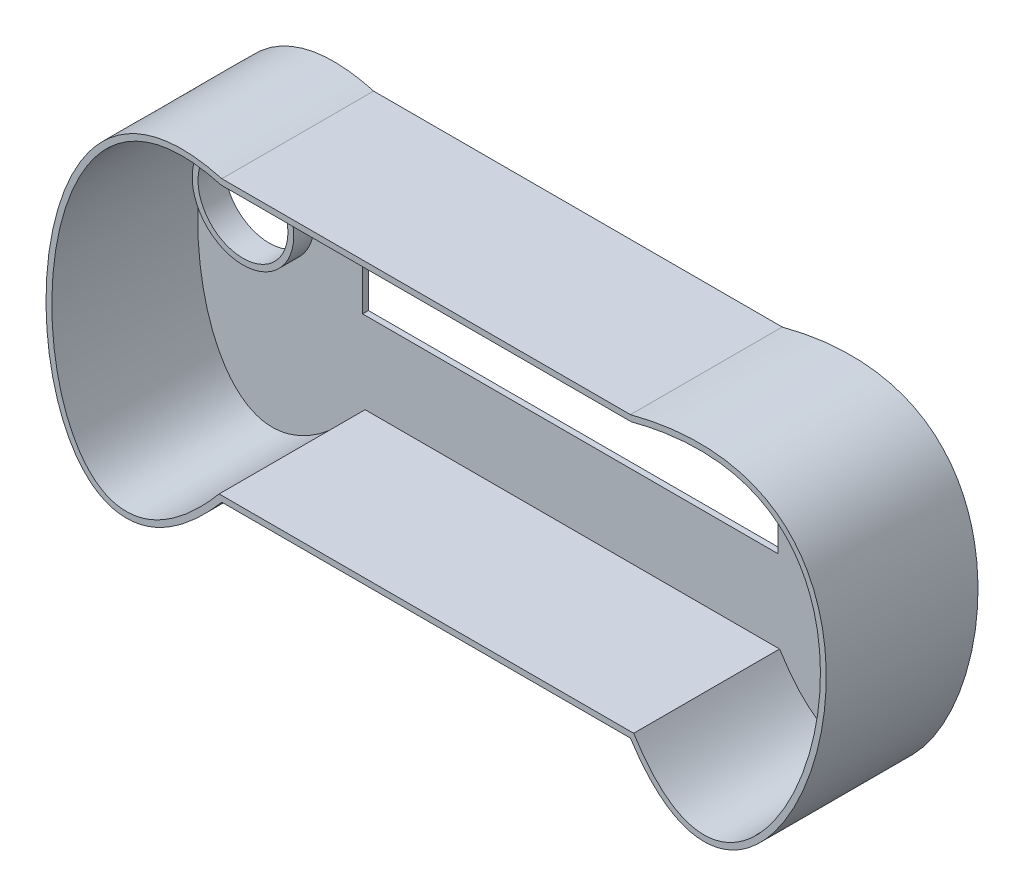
ISO-10303-21;
HEADER;
FILE_DESCRIPTION(('STEP AP214'),'2;1');
FILE_NAME('part.step','',(''),(''),'','','');
FILE_SCHEMA(('AUTOMOTIVE_DESIGN { 1 0 10303 214 1 1 1 1 }'));
ENDSEC;
DATA;
#1=APPLICATION_CONTEXT('core data for automotive mechanical design processes');
#2=APPLICATION_PROTOCOL_DEFINITION('international standard','automotive_design',2000,#1);
#3=PRODUCT_CONTEXT('',#1,'mechanical');
#4=PRODUCT('Part','Part','',(#3));
#5=PRODUCT_RELATED_PRODUCT_CATEGORY('part','',(#4));
#6=PRODUCT_DEFINITION_FORMATION('','',#4);
#7=PRODUCT_DEFINITION_CONTEXT('part definition',#1,'design');
#8=PRODUCT_DEFINITION('design','',#6,#7);
#9=PRODUCT_DEFINITION_SHAPE('','',#8);
#10=(LENGTH_UNIT() NAMED_UNIT(*) SI_UNIT(.MILLI.,.METRE.));
#11=(NAMED_UNIT(*) PLANE_ANGLE_UNIT() SI_UNIT($,.RADIAN.));
#12=(NAMED_UNIT(*) SI_UNIT($,.STERADIAN.) SOLID_ANGLE_UNIT());
#13=UNCERTAINTY_MEASURE_WITH_UNIT(LENGTH_MEASURE(1.E-05),#10,'distance_accuracy_value','');
#14=(GEOMETRIC_REPRESENTATION_CONTEXT(3) GLOBAL_UNCERTAINTY_ASSIGNED_CONTEXT((#13)) GLOBAL_UNIT_ASSIGNED_CONTEXT((#10,
#11,#12)) REPRESENTATION_CONTEXT('',''));
#15=CARTESIAN_POINT('',(0.,0.,0.));
#16=DIRECTION('',(0.,0.,1.));
#17=DIRECTION('',(1.,0.,0.));
#18=AXIS2_PLACEMENT_3D('',#15,#16,#17);
#19=CARTESIAN_POINT('',(4.92299908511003,22.9950717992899,0.));
#20=DIRECTION('',(0.,0.,1.));
#21=DIRECTION('',(1.,0.,0.));
#22=AXIS2_PLACEMENT_3D('',#19,#20,#21);
#23=PLANE('',#22);
#24=CARTESIAN_POINT('',(17.1147356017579,34.7971156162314,0.));
#25=DIRECTION('',(0.,0.,1.));
#26=DIRECTION('',(1.,0.,0.));
#27=AXIS2_PLACEMENT_3D('',#24,#25,#26);
#28=CIRCLE('',#27,8.7);
#29=CARTESIAN_POINT('',(25.8147356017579,34.7971156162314,0.));
#30=VERTEX_POINT('',#29);
#31=EDGE_CURVE('E328',#30,#30,#28,.T.);
#32=ORIENTED_EDGE('',*,*,#31,.F.);
#33=EDGE_LOOP('',(#32));
#34=FACE_BOUND('',#33,.T.);
#35=DIRECTION('',(0.,-1.,0.));
#36=VECTOR('',#35,1.);
#37=CARTESIAN_POINT('',(105.314735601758,49.7971156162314,0.));
#38=LINE('',#37,#36);
#39=CARTESIAN_POINT('',(105.314735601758,49.7971156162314,0.));
#40=VERTEX_POINT('',#39);
#41=CARTESIAN_POINT('',(105.314735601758,25.5971156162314,0.));
#42=VERTEX_POINT('',#41);
#43=EDGE_CURVE('E124',#40,#42,#38,.T.);
#44=ORIENTED_EDGE('',*,*,#43,.T.);
#45=DIRECTION('',(-1.,0.,0.));
#46=VECTOR('',#45,1.);
#47=CARTESIAN_POINT('',(105.314735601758,25.5971156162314,0.));
#48=LINE('',#47,#46);
#49=CARTESIAN_POINT('',(34.1147356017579,25.5971156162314,0.));
#50=VERTEX_POINT('',#49);
#51=EDGE_CURVE('E133',#42,#50,#48,.T.);
#52=ORIENTED_EDGE('',*,*,#51,.T.);
#53=DIRECTION('',(0.,1.,0.));
#54=VECTOR('',#53,1.);
#55=CARTESIAN_POINT('',(34.1147356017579,49.7971156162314,0.));
#56=LINE('',#55,#54);
#57=CARTESIAN_POINT('',(34.1147356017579,49.7971156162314,0.));
#58=VERTEX_POINT('',#57);
#59=EDGE_CURVE('E49',#50,#58,#56,.T.);
#60=ORIENTED_EDGE('',*,*,#59,.T.);
#61=DIRECTION('',(1.,0.,0.));
#62=VECTOR('',#61,1.);
#63=CARTESIAN_POINT('',(105.314735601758,49.7971156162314,0.));
#64=LINE('',#63,#62);
#65=EDGE_CURVE('E130',#58,#40,#64,.T.);
#66=ORIENTED_EDGE('',*,*,#65,.T.);
#67=EDGE_LOOP('',(#44,#52,#60,#66));
#68=FACE_BOUND('',#67,.T.);
#69=DIRECTION('',(-1.,0.,0.));
#70=VECTOR('',#69,1.);
#71=CARTESIAN_POINT('',(105.129049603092,57.5971156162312,0.));
#72=LINE('',#71,#70);
#73=CARTESIAN_POINT('',(105.129049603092,57.5971156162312,0.));
#74=VERTEX_POINT('',#73);
#75=CARTESIAN_POINT('',(34.8640749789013,57.5971156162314,0.));
#76=VERTEX_POINT('',#75);
#77=EDGE_CURVE('E246',#74,#76,#72,.T.);
#78=ORIENTED_EDGE('',*,*,#77,.T.);
#79=CARTESIAN_POINT('',(34.8640749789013,57.5971156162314,0.));
#80=CARTESIAN_POINT('',(34.5359122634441,57.688005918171,0.));
#81=CARTESIAN_POINT('',(33.8695946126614,57.8653706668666,0.));
#82=CARTESIAN_POINT('',(32.589473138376,58.1538757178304,0.));
#83=CARTESIAN_POINT('',(31.0301618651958,58.4184690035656,0.));
#84=CARTESIAN_POINT('',(29.2413395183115,58.581367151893,0.));
#85=CARTESIAN_POINT('',(26.9577687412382,58.6047509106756,0.));
#86=CARTESIAN_POINT('',(24.2921461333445,58.2868080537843,0.));
#87=CARTESIAN_POINT('',(20.405418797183,57.1061912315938,0.));
#88=CARTESIAN_POINT('',(16.2061984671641,54.4794709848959,0.));
#89=CARTESIAN_POINT('',(12.1481410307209,49.7855074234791,0.));
#90=CARTESIAN_POINT('',(9.07836724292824,43.8885033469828,0.));
#91=CARTESIAN_POINT('',(7.00172016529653,37.1736892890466,0.));
#92=CARTESIAN_POINT('',(5.90700760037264,30.0381631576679,0.));
#93=CARTESIAN_POINT('',(5.77162819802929,22.8816172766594,0.));
#94=CARTESIAN_POINT('',(6.56481193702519,16.1050150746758,0.));
#95=CARTESIAN_POINT('',(8.24516639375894,10.1138455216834,0.));
#96=CARTESIAN_POINT('',(10.7508480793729,5.31610445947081,0.));
#97=CARTESIAN_POINT('',(13.9656409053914,2.11506665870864,0.));
#98=CARTESIAN_POINT('',(17.1237983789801,0.968872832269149,0.));
#99=CARTESIAN_POINT('',(20.05030600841,1.06104875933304,0.));
#100=CARTESIAN_POINT('',(22.4836510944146,1.70871570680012,0.));
#101=CARTESIAN_POINT('',(25.1584900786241,3.00937023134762,0.));
#102=CARTESIAN_POINT('',(27.5789637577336,4.69289564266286,0.));
#103=CARTESIAN_POINT('',(29.6229555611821,6.42815456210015,0.));
#104=CARTESIAN_POINT('',(31.2070779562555,7.92870014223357,0.));
#105=CARTESIAN_POINT('',(32.5717833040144,9.35542883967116,0.));
#106=CARTESIAN_POINT('',(33.6821523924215,10.5940358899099,0.));
#107=CARTESIAN_POINT('',(34.2561176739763,11.265933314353,0.));
#108=CARTESIAN_POINT('',(34.5386426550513,11.5971156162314,0.));
#109=B_SPLINE_CURVE_WITH_KNOTS('',3,(#79,#80,#81,#82,#83,#84,#85,#86,#87,#88,#89,#90,#91,#92,
#93,#94,#95,#96,#97,#98,#99,#100,#101,#102,#103,#104,#105,#106,#107,#108),.UNSPECIFIED.,.F.,.F.,
(4,1,1,1,1,1,1,1,1,1,1,1,1,1,1,1,1,1,1,1,1,1,1,1,1,1,1,4),(-0.00100314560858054,
0.00683845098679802,0.0146800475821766,0.0303632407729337,0.0460464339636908,0.0617296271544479,
0.0930960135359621,0.124462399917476,0.187195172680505,0.249927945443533,0.312660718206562,
0.37539349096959,0.438126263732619,0.500859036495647,0.563591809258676,0.626324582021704,
0.689057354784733,0.751790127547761,0.814522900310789,0.845889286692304,0.877255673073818,
0.908622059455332,0.939988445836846,0.955671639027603,0.971354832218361,0.987038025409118,
0.994879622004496,1.00272121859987),.UNSPECIFIED.);
#110=CARTESIAN_POINT('',(34.5386426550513,11.5971156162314,0.));
#111=VERTEX_POINT('',#110);
#112=EDGE_CURVE('E168',#76,#111,#109,.T.);
#113=ORIENTED_EDGE('',*,*,#112,.T.);
#114=DIRECTION('',(1.,0.,0.));
#115=VECTOR('',#114,1.);
#116=CARTESIAN_POINT('',(105.549591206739,11.5971156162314,0.));
#117=LINE('',#116,#115);
#118=CARTESIAN_POINT('',(105.549591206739,11.5971156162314,0.));
#119=VERTEX_POINT('',#118);
#120=EDGE_CURVE('E255',#111,#119,#117,.T.);
#121=ORIENTED_EDGE('',*,*,#120,.T.);
#122=CARTESIAN_POINT('',(105.549591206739,11.5971156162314,0.));
#123=CARTESIAN_POINT('',(105.742871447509,11.2927236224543,0.));
#124=CARTESIAN_POINT('',(106.135036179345,10.6717388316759,0.));
#125=CARTESIAN_POINT('',(106.900552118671,9.54396310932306,0.));
#126=CARTESIAN_POINT('',(107.869141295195,8.250955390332,0.));
#127=CARTESIAN_POINT('',(109.031038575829,6.90950220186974,0.));
#128=CARTESIAN_POINT('',(110.57961756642,5.38102659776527,0.));
#129=CARTESIAN_POINT('',(112.501335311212,3.94433670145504,0.));
#130=CARTESIAN_POINT('',(114.759186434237,2.90605831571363,0.));
#131=CARTESIAN_POINT('',(116.964436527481,2.47518679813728,0.));
#132=CARTESIAN_POINT('',(119.859318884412,2.62568267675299,0.));
#133=CARTESIAN_POINT('',(123.445511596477,4.0922154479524,0.));
#134=CARTESIAN_POINT('',(127.553943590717,7.68809668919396,0.));
#135=CARTESIAN_POINT('',(131.212939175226,12.7695896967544,0.));
#136=CARTESIAN_POINT('',(134.22087719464,18.9366426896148,0.));
#137=CARTESIAN_POINT('',(136.398638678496,25.7851396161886,0.));
#138=CARTESIAN_POINT('',(137.581039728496,32.9101804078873,0.));
#139=CARTESIAN_POINT('',(137.612889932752,39.9052263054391,0.));
#140=CARTESIAN_POINT('',(136.353566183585,46.362923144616,0.));
#141=CARTESIAN_POINT('',(133.686555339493,51.8868591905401,0.));
#142=CARTESIAN_POINT('',(130.201078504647,55.4346853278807,0.));
#143=CARTESIAN_POINT('',(126.550601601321,57.5000970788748,0.));
#144=CARTESIAN_POINT('',(123.343547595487,58.6192688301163,0.));
#145=CARTESIAN_POINT('',(119.633375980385,59.2570007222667,0.));
#146=CARTESIAN_POINT('',(116.098863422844,59.3400592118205,0.));
#147=CARTESIAN_POINT('',(112.994018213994,59.1087416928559,0.));
#148=CARTESIAN_POINT('',(110.525791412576,58.7799193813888,0.));
#149=CARTESIAN_POINT('',(108.345988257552,58.3690253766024,0.));
#150=CARTESIAN_POINT('',(106.537919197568,57.9587108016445,0.));
#151=CARTESIAN_POINT('',(105.59422894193,57.719211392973,0.));
#152=CARTESIAN_POINT('',(105.129049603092,57.5971156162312,0.));
#153=B_SPLINE_CURVE_WITH_KNOTS('',3,(#122,#123,#124,#125,#126,#127,#128,#129,#130,#131,#132,
#133,#134,#135,#136,#137,#138,#139,#140,#141,#142,#143,#144,#145,#146,#147,#148,#149,#150,#151,
#152),.UNSPECIFIED.,.F.,.F.,(4,1,1,1,1,1,1,1,1,1,1,1,1,1,1,1,1,1,1,1,1,1,1,1,1,1,1,1,4),
(-0.000683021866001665,0.00716540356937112,0.0150138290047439,0.0307106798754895,
0.046407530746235,0.0621043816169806,0.0934980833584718,0.124891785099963,0.156285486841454,
0.187679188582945,0.250466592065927,0.313253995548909,0.376041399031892,0.438828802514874,
0.501616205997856,0.564403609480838,0.627191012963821,0.689978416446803,0.752765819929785,
0.815553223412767,0.846946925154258,0.878340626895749,0.90973432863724,0.941128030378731,
0.956824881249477,0.972521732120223,0.988218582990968,0.996067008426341,1.00391543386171),.UNSPECIFIED.);
#154=EDGE_CURVE('E250',#119,#74,#153,.T.);
#155=ORIENTED_EDGE('',*,*,#154,.T.);
#156=EDGE_LOOP('',(#78,#113,#121,#155));
#157=FACE_BOUND('',#156,.T.);
#158=CARTESIAN_POINT('',(122.314735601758,34.7971156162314,0.));
#159=DIRECTION('',(0.,0.,1.));
#160=DIRECTION('',(1.,0.,0.));
#161=AXIS2_PLACEMENT_3D('',#158,#159,#160);
#162=CIRCLE('',#161,8.70000000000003);
#163=CARTESIAN_POINT('',(131.014735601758,34.7971156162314,0.));
#164=VERTEX_POINT('',#163);
#165=EDGE_CURVE('E315',#164,#164,#162,.T.);
#166=ORIENTED_EDGE('',*,*,#165,.F.);
#167=EDGE_LOOP('',(#166));
#168=FACE_BOUND('',#167,.T.);
#169=ADVANCED_FACE('F32',(#34,#68,#157,#168),#23,.T.);
#170=CARTESIAN_POINT('',(4.92299908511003,22.9950717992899,25.));
#171=DIRECTION('',(0.,0.,-1.));
#172=DIRECTION('',(-1.,0.,0.));
#173=AXIS2_PLACEMENT_3D('',#170,#171,#172);
#174=PLANE('',#173);
#175=CARTESIAN_POINT('',(35.,58.5971156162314,25.));
#176=CARTESIAN_POINT('',(-8.52759174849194,70.6528299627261,25.));
#177=CARTESIAN_POINT('',(-1.67774402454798,-32.3973822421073,25.));
#178=CARTESIAN_POINT('',(35.,10.5971156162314,25.));
#179=B_SPLINE_CURVE_WITH_KNOTS('',3,(#175,#176,#177,#178),.UNSPECIFIED.,.F.,.F.,(4,4),(0.,1.),.UNSPECIFIED.);
#180=CARTESIAN_POINT('',(35.,58.5971156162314,25.));
#181=VERTEX_POINT('',#180);
#182=CARTESIAN_POINT('',(35.,10.5971156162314,25.));
#183=VERTEX_POINT('',#182);
#184=EDGE_CURVE('E222',#181,#183,#179,.T.);
#185=ORIENTED_EDGE('',*,*,#184,.T.);
#186=DIRECTION('',(1.,0.,0.));
#187=VECTOR('',#186,1.);
#188=CARTESIAN_POINT('',(105.,10.5971156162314,25.));
#189=LINE('',#188,#187);
#190=CARTESIAN_POINT('',(105.,10.5971156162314,25.));
#191=VERTEX_POINT('',#190);
#192=EDGE_CURVE('E200',#183,#191,#189,.T.);
#193=ORIENTED_EDGE('',*,*,#192,.T.);
#194=CARTESIAN_POINT('',(105.,10.5971156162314,25.));
#195=CARTESIAN_POINT('',(130.080420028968,-28.9013816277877,25.));
#196=CARTESIAN_POINT('',(165.916391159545,74.5858611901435,25.));
#197=CARTESIAN_POINT('',(105.,58.5971156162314,25.));
#198=B_SPLINE_CURVE_WITH_KNOTS('',3,(#194,#195,#196,#197),.UNSPECIFIED.,.F.,.F.,(4,4),(0.,1.),.UNSPECIFIED.);
#199=CARTESIAN_POINT('',(105.,58.5971156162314,25.));
#200=VERTEX_POINT('',#199);
#201=EDGE_CURVE('E193',#191,#200,#198,.T.);
#202=ORIENTED_EDGE('',*,*,#201,.T.);
#203=DIRECTION('',(-1.,0.,0.));
#204=VECTOR('',#203,1.);
#205=CARTESIAN_POINT('',(105.,58.5971156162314,25.));
#206=LINE('',#205,#204);
#207=EDGE_CURVE('E199',#200,#181,#206,.T.);
#208=ORIENTED_EDGE('',*,*,#207,.T.);
#209=EDGE_LOOP('',(#185,#193,#202,#208));
#210=FACE_BOUND('',#209,.T.);
#211=CARTESIAN_POINT('',(34.8640749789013,57.5971156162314,25.));
#212=CARTESIAN_POINT('',(34.5359122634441,57.688005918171,25.));
#213=CARTESIAN_POINT('',(33.8695946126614,57.8653706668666,25.));
#214=CARTESIAN_POINT('',(32.589473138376,58.1538757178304,25.));
#215=CARTESIAN_POINT('',(31.0301618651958,58.4184690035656,25.));
#216=CARTESIAN_POINT('',(29.2413395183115,58.581367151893,25.));
#217=CARTESIAN_POINT('',(26.9577687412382,58.6047509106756,25.));
#218=CARTESIAN_POINT('',(24.2921461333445,58.2868080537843,25.));
#219=CARTESIAN_POINT('',(20.405418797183,57.1061912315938,25.));
#220=CARTESIAN_POINT('',(16.2061984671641,54.4794709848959,25.));
#221=CARTESIAN_POINT('',(12.1481410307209,49.7855074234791,25.));
#222=CARTESIAN_POINT('',(9.07836724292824,43.8885033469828,25.));
#223=CARTESIAN_POINT('',(7.00172016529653,37.1736892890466,25.));
#224=CARTESIAN_POINT('',(5.90700760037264,30.0381631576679,25.));
#225=CARTESIAN_POINT('',(5.77162819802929,22.8816172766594,25.));
#226=CARTESIAN_POINT('',(6.56481193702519,16.1050150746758,25.));
#227=CARTESIAN_POINT('',(8.24516639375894,10.1138455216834,25.));
#228=CARTESIAN_POINT('',(10.7508480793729,5.31610445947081,25.));
#229=CARTESIAN_POINT('',(13.9656409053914,2.11506665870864,25.));
#230=CARTESIAN_POINT('',(17.1237983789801,0.968872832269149,25.));
#231=CARTESIAN_POINT('',(20.05030600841,1.06104875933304,25.));
#232=CARTESIAN_POINT('',(22.4836510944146,1.70871570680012,25.));
#233=CARTESIAN_POINT('',(25.1584900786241,3.00937023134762,25.));
#234=CARTESIAN_POINT('',(27.5789637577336,4.69289564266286,25.));
#235=CARTESIAN_POINT('',(29.6229555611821,6.42815456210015,25.));
#236=CARTESIAN_POINT('',(31.2070779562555,7.92870014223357,25.));
#237=CARTESIAN_POINT('',(32.5717833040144,9.35542883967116,25.));
#238=CARTESIAN_POINT('',(33.6821523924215,10.5940358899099,25.));
#239=CARTESIAN_POINT('',(34.2561176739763,11.265933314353,25.));
#240=CARTESIAN_POINT('',(34.5386426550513,11.5971156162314,25.));
#241=B_SPLINE_CURVE_WITH_KNOTS('',3,(#211,#212,#213,#214,#215,#216,#217,#218,#219,#220,#221,
#222,#223,#224,#225,#226,#227,#228,#229,#230,#231,#232,#233,#234,#235,#236,#237,#238,#239,#240),
.UNSPECIFIED.,.F.,.F.,(4,1,1,1,1,1,1,1,1,1,1,1,1,1,1,1,1,1,1,1,1,1,1,1,1,1,1,4),
(-0.00100314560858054,0.00683845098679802,0.0146800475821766,0.0303632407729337,
0.0460464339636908,0.0617296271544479,0.0930960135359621,0.124462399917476,0.187195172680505,
0.249927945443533,0.312660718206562,0.37539349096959,0.438126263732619,0.500859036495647,
0.563591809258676,0.626324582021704,0.689057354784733,0.751790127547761,0.814522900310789,
0.845889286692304,0.877255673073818,0.908622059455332,0.939988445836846,0.955671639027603,
0.971354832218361,0.987038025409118,0.994879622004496,1.00272121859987),.UNSPECIFIED.);
#242=CARTESIAN_POINT('',(34.8640749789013,57.5971156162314,25.));
#243=VERTEX_POINT('',#242);
#244=CARTESIAN_POINT('',(34.5386426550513,11.5971156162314,25.));
#245=VERTEX_POINT('',#244);
#246=EDGE_CURVE('E249',#243,#245,#241,.T.);
#247=ORIENTED_EDGE('',*,*,#246,.F.);
#248=DIRECTION('',(-1.,0.,0.));
#249=VECTOR('',#248,1.);
#250=CARTESIAN_POINT('',(105.129049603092,57.5971156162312,25.));
#251=LINE('',#250,#249);
#252=CARTESIAN_POINT('',(105.129049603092,57.5971156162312,25.));
#253=VERTEX_POINT('',#252);
#254=EDGE_CURVE('E245',#253,#243,#251,.T.);
#255=ORIENTED_EDGE('',*,*,#254,.F.);
#256=CARTESIAN_POINT('',(105.549591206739,11.5971156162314,25.));
#257=CARTESIAN_POINT('',(105.742871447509,11.2927236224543,25.));
#258=CARTESIAN_POINT('',(106.135036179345,10.6717388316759,25.));
#259=CARTESIAN_POINT('',(106.900552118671,9.54396310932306,25.));
#260=CARTESIAN_POINT('',(107.869141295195,8.250955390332,25.));
#261=CARTESIAN_POINT('',(109.031038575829,6.90950220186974,25.));
#262=CARTESIAN_POINT('',(110.57961756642,5.38102659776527,25.));
#263=CARTESIAN_POINT('',(112.501335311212,3.94433670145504,25.));
#264=CARTESIAN_POINT('',(114.759186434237,2.90605831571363,25.));
#265=CARTESIAN_POINT('',(116.964436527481,2.47518679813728,25.));
#266=CARTESIAN_POINT('',(119.859318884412,2.62568267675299,25.));
#267=CARTESIAN_POINT('',(123.445511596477,4.0922154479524,25.));
#268=CARTESIAN_POINT('',(127.553943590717,7.68809668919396,25.));
#269=CARTESIAN_POINT('',(131.212939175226,12.7695896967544,25.));
#270=CARTESIAN_POINT('',(134.22087719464,18.9366426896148,25.));
#271=CARTESIAN_POINT('',(136.398638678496,25.7851396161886,25.));
#272=CARTESIAN_POINT('',(137.581039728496,32.9101804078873,25.));
#273=CARTESIAN_POINT('',(137.612889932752,39.9052263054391,25.));
#274=CARTESIAN_POINT('',(136.353566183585,46.362923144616,25.));
#275=CARTESIAN_POINT('',(133.686555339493,51.8868591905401,25.));
#276=CARTESIAN_POINT('',(130.201078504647,55.4346853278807,25.));
#277=CARTESIAN_POINT('',(126.550601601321,57.5000970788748,25.));
#278=CARTESIAN_POINT('',(123.343547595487,58.6192688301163,25.));
#279=CARTESIAN_POINT('',(119.633375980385,59.2570007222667,25.));
#280=CARTESIAN_POINT('',(116.098863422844,59.3400592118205,25.));
#281=CARTESIAN_POINT('',(112.994018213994,59.1087416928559,25.));
#282=CARTESIAN_POINT('',(110.525791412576,58.7799193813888,25.));
#283=CARTESIAN_POINT('',(108.345988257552,58.3690253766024,25.));
#284=CARTESIAN_POINT('',(106.537919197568,57.9587108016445,25.));
#285=CARTESIAN_POINT('',(105.59422894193,57.719211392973,25.));
#286=CARTESIAN_POINT('',(105.129049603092,57.5971156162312,25.));
#287=B_SPLINE_CURVE_WITH_KNOTS('',3,(#256,#257,#258,#259,#260,#261,#262,#263,#264,#265,#266,
#267,#268,#269,#270,#271,#272,#273,#274,#275,#276,#277,#278,#279,#280,#281,#282,#283,#284,#285,
#286),.UNSPECIFIED.,.F.,.F.,(4,1,1,1,1,1,1,1,1,1,1,1,1,1,1,1,1,1,1,1,1,1,1,1,1,1,1,1,4),
(-0.000683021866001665,0.00716540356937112,0.0150138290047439,0.0307106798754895,
0.046407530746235,0.0621043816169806,0.0934980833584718,0.124891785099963,0.156285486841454,
0.187679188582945,0.250466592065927,0.313253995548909,0.376041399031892,0.438828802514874,
0.501616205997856,0.564403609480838,0.627191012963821,0.689978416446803,0.752765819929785,
0.815553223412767,0.846946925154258,0.878340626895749,0.90973432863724,0.941128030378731,
0.956824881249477,0.972521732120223,0.988218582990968,0.996067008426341,1.00391543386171),.UNSPECIFIED.);
#288=CARTESIAN_POINT('',(105.549591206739,11.5971156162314,25.));
#289=VERTEX_POINT('',#288);
#290=EDGE_CURVE('E269',#289,#253,#287,.T.);
#291=ORIENTED_EDGE('',*,*,#290,.F.);
#292=DIRECTION('',(1.,0.,0.));
#293=VECTOR('',#292,1.);
#294=CARTESIAN_POINT('',(105.549591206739,11.5971156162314,25.));
#295=LINE('',#294,#293);
#296=EDGE_CURVE('E275',#245,#289,#295,.T.);
#297=ORIENTED_EDGE('',*,*,#296,.F.);
#298=EDGE_LOOP('',(#247,#255,#291,#297));
#299=FACE_BOUND('',#298,.T.);
#300=ADVANCED_FACE('F227',(#210,#299),#174,.F.);
#301=DIRECTION('',(0.,0.,-1.));
#302=VECTOR('',#301,1.);
#303=SURFACE_OF_LINEAR_EXTRUSION('',#179,#302);
#304=DIRECTION('',(0.,0.,-1.));
#305=VECTOR('',#304,1.);
#306=CARTESIAN_POINT('',(35.,58.5971156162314,25.));
#307=LINE('',#306,#305);
#308=CARTESIAN_POINT('',(35.,58.5971156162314,-1.));
#309=VERTEX_POINT('',#308);
#310=EDGE_CURVE('E205',#181,#309,#307,.T.);
#311=ORIENTED_EDGE('',*,*,#310,.T.);
#312=CARTESIAN_POINT('',(35.,10.5971156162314,-1.));
#313=CARTESIAN_POINT('',(34.7213641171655,10.270523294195,-1.));
#314=CARTESIAN_POINT('',(34.4395802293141,9.94659099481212,-1.));
#315=CARTESIAN_POINT('',(33.8670299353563,9.30231044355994,-1.));
#316=CARTESIAN_POINT('',(33.5762112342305,8.9820086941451,-1.));
#317=CARTESIAN_POINT('',(32.9856108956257,8.34661548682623,-1.));
#318=CARTESIAN_POINT('',(32.6857901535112,8.03156030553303,-1.));
#319=CARTESIAN_POINT('',(32.0771301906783,7.40837500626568,-1.));
#320=CARTESIAN_POINT('',(31.768266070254,7.10026916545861,-1.));
#321=CARTESIAN_POINT('',(31.1413907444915,6.49276438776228,-1.));
#322=CARTESIAN_POINT('',(30.8233695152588,6.19337577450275,-1.));
#323=CARTESIAN_POINT('',(30.161831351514,5.59049284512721,-1.));
#324=CARTESIAN_POINT('',(29.8178311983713,5.28752710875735,-1.));
#325=CARTESIAN_POINT('',(29.1189382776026,4.69547532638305,-1.));
#326=CARTESIAN_POINT('',(28.7640626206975,4.4063691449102,-1.));
#327=CARTESIAN_POINT('',(28.0427228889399,3.84455903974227,-1.));
#328=CARTESIAN_POINT('',(27.6762852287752,3.57182135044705,-1.));
#329=CARTESIAN_POINT('',(26.9308815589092,3.04562652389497,-1.));
#330=CARTESIAN_POINT('',(26.5519424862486,2.79213137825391,-0.999999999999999));
#331=CARTESIAN_POINT('',(25.7801645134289,2.3077392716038,-1.));
#332=CARTESIAN_POINT('',(25.3873369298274,2.0768244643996,-1.));
#333=CARTESIAN_POINT('',(24.7670589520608,1.74001322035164,-1.));
#334=CARTESIAN_POINT('',(24.5447418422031,1.62462115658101,-1.));
#335=CARTESIAN_POINT('',(24.0955077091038,1.40297533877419,-1.));
#336=CARTESIAN_POINT('',(23.8685895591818,1.29672385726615,-1.));
#337=CARTESIAN_POINT('',(23.4101760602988,1.09442693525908,-1.));
#338=CARTESIAN_POINT('',(23.1786797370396,0.998383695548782,-1.));
#339=CARTESIAN_POINT('',(22.7130318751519,0.818388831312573,-1.));
#340=CARTESIAN_POINT('',(22.4789137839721,0.734351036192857,-1.));
#341=CARTESIAN_POINT('',(22.0065693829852,0.578776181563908,-1.));
#342=CARTESIAN_POINT('',(21.7683435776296,0.507237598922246,-1.));
#343=CARTESIAN_POINT('',(21.2882187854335,0.378014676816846,-1.));
#344=CARTESIAN_POINT('',(21.0463208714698,0.320326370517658,-1.));
#345=CARTESIAN_POINT('',(20.5296245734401,0.214058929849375,-1.));
#346=CARTESIAN_POINT('',(20.2544145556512,0.167451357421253,-1.));
#347=CARTESIAN_POINT('',(19.7012329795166,0.0953692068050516,-1.));
#348=CARTESIAN_POINT('',(19.423261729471,0.0698922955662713,-1.));
#349=CARTESIAN_POINT('',(18.8661464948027,0.0418460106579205,-1.));
#350=CARTESIAN_POINT('',(18.5870026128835,0.0392746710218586,-1.));
#351=CARTESIAN_POINT('',(18.0295171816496,0.0584434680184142,-1.));
#352=CARTESIAN_POINT('',(17.7511756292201,0.0801835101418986,-1.));
#353=CARTESIAN_POINT('',(17.1959576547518,0.149005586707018,-1.));
#354=CARTESIAN_POINT('',(16.9190994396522,0.196235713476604,-1.));
#355=CARTESIAN_POINT('',(16.3709651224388,0.316223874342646,-1.));
#356=CARTESIAN_POINT('',(16.099689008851,0.38898185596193,-1.));
#357=CARTESIAN_POINT('',(15.5649722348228,0.5593360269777,-1.));
#358=CARTESIAN_POINT('',(15.3015340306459,0.656939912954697,-1.));
#359=CARTESIAN_POINT('',(14.7845742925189,0.875540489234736,-1.));
#360=CARTESIAN_POINT('',(14.5310527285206,0.996537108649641,-1.));
#361=CARTESIAN_POINT('',(14.0556182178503,1.24922066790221,-1.));
#362=CARTESIAN_POINT('',(13.8328118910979,1.37923652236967,-1.));
#363=CARTESIAN_POINT('',(13.3975192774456,1.65564346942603,-1.));
#364=CARTESIAN_POINT('',(13.185036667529,1.80204033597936,-1.));
#365=CARTESIAN_POINT('',(12.770918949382,2.10933810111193,-1.));
#366=CARTESIAN_POINT('',(12.5692821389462,2.27023671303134,-1.));
#367=CARTESIAN_POINT('',(12.1768858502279,2.60482526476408,-1.));
#368=CARTESIAN_POINT('',(11.9861292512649,2.77851856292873,-1.));
#369=CARTESIAN_POINT('',(11.4866070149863,3.26159895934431,-1.));
#370=CARTESIAN_POINT('',(11.1879011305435,3.58144115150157,-1.));
#371=CARTESIAN_POINT('',(10.6198476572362,4.24623541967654,-0.999999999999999));
#372=CARTESIAN_POINT('',(10.3505181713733,4.59120276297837,-1.));
#373=CARTESIAN_POINT('',(9.83840963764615,5.30164229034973,-1.));
#374=CARTESIAN_POINT('',(9.59570565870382,5.66716826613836,-1.));
#375=CARTESIAN_POINT('',(9.13538991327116,6.41352822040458,-1.));
#376=CARTESIAN_POINT('',(8.91777581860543,6.79436077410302,-1.));
#377=CARTESIAN_POINT('',(8.46586196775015,7.64220731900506,-1.));
#378=CARTESIAN_POINT('',(8.23634369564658,8.11176230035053,-1.));
#379=CARTESIAN_POINT('',(7.80618505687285,9.06418131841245,-1.));
#380=CARTESIAN_POINT('',(7.60556419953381,9.54705408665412,-1.));
#381=CARTESIAN_POINT('',(7.23045948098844,10.5229317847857,-1.));
#382=CARTESIAN_POINT('',(7.05598235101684,11.0159392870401,-1.));
#383=CARTESIAN_POINT('',(6.73052317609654,12.0106653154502,-1.));
#384=CARTESIAN_POINT('',(6.57958748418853,12.5123989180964,-1.));
#385=CARTESIAN_POINT('',(6.2996864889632,13.5217333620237,-1.));
#386=CARTESIAN_POINT('',(6.17071339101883,14.0293320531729,-1.));
#387=CARTESIAN_POINT('',(5.93304163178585,15.0492585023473,-1.));
#388=CARTESIAN_POINT('',(5.82434395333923,15.5615864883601,-1.));
#389=CARTESIAN_POINT('',(5.63690022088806,16.5329124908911,-1.));
#390=CARTESIAN_POINT('',(5.55616998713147,16.9915299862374,-1.));
#391=CARTESIAN_POINT('',(5.40893781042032,17.911052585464,-1.));
#392=CARTESIAN_POINT('',(5.34243670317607,18.371957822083,-1.));
#393=CARTESIAN_POINT('',(5.16323962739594,19.7577954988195,-1.));
#394=CARTESIAN_POINT('',(5.07093022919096,20.6854262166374,-1.));
#395=CARTESIAN_POINT('',(4.93693276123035,22.5445162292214,-1.));
#396=CARTESIAN_POINT('',(4.8952613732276,23.4759766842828,-1.));
#397=CARTESIAN_POINT('',(4.86033089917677,25.3409363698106,-1.));
#398=CARTESIAN_POINT('',(4.86713108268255,26.2744367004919,-1.));
#399=CARTESIAN_POINT('',(4.92820176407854,28.1395119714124,-1.));
#400=CARTESIAN_POINT('',(4.98245430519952,29.0710875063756,-1.));
#401=CARTESIAN_POINT('',(5.1383470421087,30.9301143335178,-1.));
#402=CARTESIAN_POINT('',(5.23997811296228,31.8575663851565,-1.));
#403=CARTESIAN_POINT('',(5.47116583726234,33.5562781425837,-1.));
#404=CARTESIAN_POINT('',(5.59353967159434,34.3285206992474,-1.));
#405=CARTESIAN_POINT('',(5.87324673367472,35.8666910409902,-1.));
#406=CARTESIAN_POINT('',(6.03058029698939,36.6326187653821,-1.));
#407=CARTESIAN_POINT('',(6.3817281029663,38.1563165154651,-1.));
#408=CARTESIAN_POINT('',(6.57555219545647,38.9140842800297,-1.));
#409=CARTESIAN_POINT('',(7.00100877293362,40.4167091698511,-1.));
#410=CARTESIAN_POINT('',(7.23253483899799,41.1615962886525,-1.));
#411=CARTESIAN_POINT('',(7.7361204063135,42.6374359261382,-1.));
#412=CARTESIAN_POINT('',(8.00817139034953,43.3683913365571,-1.));
#413=CARTESIAN_POINT('',(8.59554069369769,44.8123552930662,-1.));
#414=CARTESIAN_POINT('',(8.91083621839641,45.5253730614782,-1.));
#415=CARTESIAN_POINT('',(9.55039476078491,46.8509674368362,-1.));
#416=CARTESIAN_POINT('',(9.86975826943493,47.4658937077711,-1.));
#417=CARTESIAN_POINT('',(10.3781802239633,48.3716677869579,-1.));
#418=CARTESIAN_POINT('',(10.5525435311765,48.6708128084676,-1.));
#419=CARTESIAN_POINT('',(10.9114435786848,49.2630634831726,-1.));
#420=CARTESIAN_POINT('',(11.0959835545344,49.5561671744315,-1.));
#421=CARTESIAN_POINT('',(11.6649020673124,50.4247321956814,-1.));
#422=CARTESIAN_POINT('',(12.0649352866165,50.9900869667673,-1.));
#423=CARTESIAN_POINT('',(12.9086697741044,52.0870804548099,-1.));
#424=CARTESIAN_POINT('',(13.3523557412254,52.6187308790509,-1.));
#425=CARTESIAN_POINT('',(14.1973159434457,53.5449992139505,-1.));
#426=CARTESIAN_POINT('',(14.5909212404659,53.9466084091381,-1.));
#427=CARTESIAN_POINT('',(15.4080367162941,54.718229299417,-1.));
#428=CARTESIAN_POINT('',(15.8315439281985,55.0882441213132,-1.));
#429=CARTESIAN_POINT('',(16.7073848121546,55.7916473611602,-0.999999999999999));
#430=CARTESIAN_POINT('',(17.1596914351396,56.1250693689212,-0.999999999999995));
#431=CARTESIAN_POINT('',(18.0918733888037,56.7510906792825,-1.00000000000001));
#432=CARTESIAN_POINT('',(18.5717484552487,57.0436903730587,-1.00000000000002));
#433=CARTESIAN_POINT('',(19.394133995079,57.4950417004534,-1.00000000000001));
#434=CARTESIAN_POINT('',(19.7299121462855,57.666163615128,-1.));
#435=CARTESIAN_POINT('',(20.4114981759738,57.9872318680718,-0.999999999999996));
#436=CARTESIAN_POINT('',(20.7573065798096,58.1371770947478,-0.999999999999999));
#437=CARTESIAN_POINT('',(21.4576108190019,58.4151212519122,-1.));
#438=CARTESIAN_POINT('',(21.8121062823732,58.5431211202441,-1.));
#439=CARTESIAN_POINT('',(22.5284200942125,58.776763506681,-1.));
#440=CARTESIAN_POINT('',(22.8902390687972,58.8824041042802,-1.));
#441=CARTESIAN_POINT('',(23.6197052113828,59.0711974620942,-1.));
#442=CARTESIAN_POINT('',(23.9873525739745,59.1543494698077,-1.));
#443=CARTESIAN_POINT('',(24.7269224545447,59.2983485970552,-1.));
#444=CARTESIAN_POINT('',(25.0988445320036,59.3591979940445,-1.));
#445=CARTESIAN_POINT('',(25.9815170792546,59.4772472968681,-1.));
#446=CARTESIAN_POINT('',(26.4935417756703,59.5250633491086,-1.));
#447=CARTESIAN_POINT('',(27.5196287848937,59.5819818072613,-1.));
#448=CARTESIAN_POINT('',(28.0336910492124,59.5910851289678,-1.));
#449=CARTESIAN_POINT('',(29.0615710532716,59.5730785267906,-0.999999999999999));
#450=CARTESIAN_POINT('',(29.5753882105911,59.5459377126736,-0.999999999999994));
#451=CARTESIAN_POINT('',(30.600027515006,59.458212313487,-1.00000000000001));
#452=CARTESIAN_POINT('',(31.1108499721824,59.3976312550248,-1.00000000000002));
#453=CARTESIAN_POINT('',(32.1908546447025,59.2365523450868,-1.00000000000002));
#454=CARTESIAN_POINT('',(32.7594392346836,59.1320436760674,-1.));
#455=CARTESIAN_POINT('',(33.6054516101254,58.9496800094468,-0.999999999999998));
#456=CARTESIAN_POINT('',(33.8857586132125,58.8847803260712,-0.999999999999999));
#457=CARTESIAN_POINT('',(34.4443915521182,58.7468957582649,-1.));
#458=CARTESIAN_POINT('',(34.7227174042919,58.6739105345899,-1.));
#459=CARTESIAN_POINT('',(35.,58.5971156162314,-1.));
#460=B_SPLINE_CURVE_WITH_KNOTS('',3,(#312,#313,#314,#315,#316,#317,#318,#319,#320,#321,#322,
#323,#324,#325,#326,#327,#328,#329,#330,#331,#332,#333,#334,#335,#336,#337,#338,#339,#340,#341,
#342,#343,#344,#345,#346,#347,#348,#349,#350,#351,#352,#353,#354,#355,#356,#357,#358,#359,#360,
#361,#362,#363,#364,#365,#366,#367,#368,#369,#370,#371,#372,#373,#374,#375,#376,#377,#378,#379,
#380,#381,#382,#383,#384,#385,#386,#387,#388,#389,#390,#391,#392,#393,#394,#395,#396,#397,#398,
#399,#400,#401,#402,#403,#404,#405,#406,#407,#408,#409,#410,#411,#412,#413,#414,#415,#416,#417,
#418,#419,#420,#421,#422,#423,#424,#425,#426,#427,#428,#429,#430,#431,#432,#433,#434,#435,#436,
#437,#438,#439,#440,#441,#442,#443,#444,#445,#446,#447,#448,#449,#450,#451,#452,#453,#454,#455,
#456,#457,#458,#459),.UNSPECIFIED.,.F.,.F.,(4,2,2,2,2,2,2,2,2,2,2,2,2,2,2,2,2,2,2,2,2,2,2,2,2,2,
2,2,2,2,2,2,2,2,2,2,2,2,2,2,2,2,2,2,2,2,2,2,2,2,2,2,2,2,2,2,2,2,2,2,2,2,2,2,2,2,2,2,2,2,2,2,2,
4),(0.,1.28791642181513,2.58570457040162,3.89032036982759,5.19894838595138,6.50906786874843,
7.88394763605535,9.25676533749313,10.626646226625,11.9937468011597,13.35975801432,
14.111024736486,14.8624777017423,15.6140923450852,16.3600073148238,17.1058313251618,
17.8514414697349,18.6880678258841,19.5246017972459,20.3610639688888,21.1975228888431,
22.0388946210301,22.8802646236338,23.7218955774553,24.5635239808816,25.3366666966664,
26.1100827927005,26.8833771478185,27.6568752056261,28.9676168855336,30.279161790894,
31.5943143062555,32.9093446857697,34.476132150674,36.0439724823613,37.6122157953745,
39.1835090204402,40.7542434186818,42.325053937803,43.721823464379,45.1186750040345,
47.9136696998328,50.7095849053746,53.5089194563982,56.3071951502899,59.1049321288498,
61.449818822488,63.7947280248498,66.1402710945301,68.4793047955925,70.8178475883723,
73.155162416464,75.2324627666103,76.2710383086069,77.3099459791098,79.3855703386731,
81.4604697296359,83.14594408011,84.83125143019,86.51499860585,88.1987296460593,89.3286725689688,
90.4586747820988,91.5886286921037,92.7186796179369,93.8487683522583,94.9787416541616,
96.5198634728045,98.0609488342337,99.6033484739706,101.145585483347,102.878603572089,
103.741671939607,104.604776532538),.UNSPECIFIED.);
#461=CARTESIAN_POINT('',(35.,10.5971156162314,-1.));
#462=VERTEX_POINT('',#461);
#463=EDGE_CURVE('E157',#462,#309,#460,.T.);
#464=ORIENTED_EDGE('',*,*,#463,.F.);
#465=DIRECTION('',(0.,0.,-1.));
#466=VECTOR('',#465,1.);
#467=CARTESIAN_POINT('',(35.,10.5971156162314,25.));
#468=LINE('',#467,#466);
#469=EDGE_CURVE('E11',#183,#462,#468,.T.);
#470=ORIENTED_EDGE('',*,*,#469,.F.);
#471=ORIENTED_EDGE('',*,*,#184,.F.);
#472=EDGE_LOOP('',(#311,#464,#470,#471));
#473=FACE_BOUND('',#472,.T.);
#474=ADVANCED_FACE('F34',(#473),#303,.F.);
#475=CARTESIAN_POINT('',(105.,10.5971156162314,25.));
#476=DIRECTION('',(0.,1.,0.));
#477=DIRECTION('',(-1.,0.,0.));
#478=AXIS2_PLACEMENT_3D('',#475,#476,#477);
#479=PLANE('',#478);
#480=ORIENTED_EDGE('',*,*,#469,.T.);
#481=DIRECTION('',(-1.,0.,0.));
#482=VECTOR('',#481,1.);
#483=CARTESIAN_POINT('',(105.,10.5971156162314,-1.));
#484=LINE('',#483,#482);
#485=CARTESIAN_POINT('',(105.,10.5971156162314,-1.));
#486=VERTEX_POINT('',#485);
#487=EDGE_CURVE('E165',#486,#462,#484,.T.);
#488=ORIENTED_EDGE('',*,*,#487,.F.);
#489=DIRECTION('',(0.,0.,-1.));
#490=VECTOR('',#489,1.);
#491=CARTESIAN_POINT('',(105.,10.5971156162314,25.));
#492=LINE('',#491,#490);
#493=EDGE_CURVE('E42',#191,#486,#492,.T.);
#494=ORIENTED_EDGE('',*,*,#493,.F.);
#495=ORIENTED_EDGE('',*,*,#192,.F.);
#496=EDGE_LOOP('',(#480,#488,#494,#495));
#497=FACE_BOUND('',#496,.T.);
#498=ADVANCED_FACE('F190',(#497),#479,.F.);
#499=DIRECTION('',(0.,0.,-1.));
#500=VECTOR('',#499,1.);
#501=SURFACE_OF_LINEAR_EXTRUSION('',#198,#500);
#502=ORIENTED_EDGE('',*,*,#493,.T.);
#503=CARTESIAN_POINT('',(105.,58.5971156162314,-1.));
#504=CARTESIAN_POINT('',(105.516997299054,58.732788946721,-1.));
#505=CARTESIAN_POINT('',(106.03568086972,58.8621729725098,-1.));
#506=CARTESIAN_POINT('',(107.076791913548,59.1072140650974,-1.));
#507=CARTESIAN_POINT('',(107.599222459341,59.222858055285,-1.));
#508=CARTESIAN_POINT('',(108.647380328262,59.4390423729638,-1.));
#509=CARTESIAN_POINT('',(109.173108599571,59.5395781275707,-1.));
#510=CARTESIAN_POINT('',(110.237487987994,59.7257818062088,-1.));
#511=CARTESIAN_POINT('',(110.7761950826,59.8111315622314,-1.));
#512=CARTESIAN_POINT('',(111.856170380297,59.9628158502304,-1.));
#513=CARTESIAN_POINT('',(112.397437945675,60.0291548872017,-1.));
#514=CARTESIAN_POINT('',(113.482139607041,60.1408783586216,-1.));
#515=CARTESIAN_POINT('',(114.025573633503,60.1862634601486,-1.));
#516=CARTESIAN_POINT('',(115.1171046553,60.2540818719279,-1.));
#517=CARTESIAN_POINT('',(115.665210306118,60.2763790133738,-1.));
#518=CARTESIAN_POINT('',(116.761952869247,60.2950670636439,-1.));
#519=CARTESIAN_POINT('',(117.310589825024,60.2914556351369,-1.));
#520=CARTESIAN_POINT('',(118.407142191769,60.2555943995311,-1.));
#521=CARTESIAN_POINT('',(118.95505733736,60.2233360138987,-1.));
#522=CARTESIAN_POINT('',(120.044413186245,60.1275825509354,-1.));
#523=CARTESIAN_POINT('',(120.585872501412,60.0643038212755,-1.));
#524=CARTESIAN_POINT('',(121.663658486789,59.9036733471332,-1.));
#525=CARTESIAN_POINT('',(122.199986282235,59.8063292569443,-1.));
#526=CARTESIAN_POINT('',(123.26434982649,59.5747312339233,-1.));
#527=CARTESIAN_POINT('',(123.792390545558,59.4405003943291,-1.));
#528=CARTESIAN_POINT('',(124.813168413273,59.1394873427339,-1.));
#529=CARTESIAN_POINT('',(125.306420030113,58.9744594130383,-1.));
#530=CARTESIAN_POINT('',(126.278618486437,58.6066092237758,-1.));
#531=CARTESIAN_POINT('',(126.757567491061,58.4037927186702,-1.));
#532=CARTESIAN_POINT('',(127.697062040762,57.9593650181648,-1.));
#533=CARTESIAN_POINT('',(128.157611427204,57.7177619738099,-1.));
#534=CARTESIAN_POINT('',(129.056195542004,57.1956976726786,-1.));
#535=CARTESIAN_POINT('',(129.494230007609,56.9152359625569,-1.));
#536=CARTESIAN_POINT('',(130.345370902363,56.3154263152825,-1.));
#537=CARTESIAN_POINT('',(130.758375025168,55.995933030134,-1.));
#538=CARTESIAN_POINT('',(131.55408350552,55.3212181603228,-1.));
#539=CARTESIAN_POINT('',(131.936787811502,54.9659965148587,-1.));
#540=CARTESIAN_POINT('',(132.669382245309,54.2229500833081,-1.));
#541=CARTESIAN_POINT('',(133.019259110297,53.8351122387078,-1.));
#542=CARTESIAN_POINT('',(133.684414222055,53.030871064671,-1.));
#543=CARTESIAN_POINT('',(133.999691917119,52.6144672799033,-1.));
#544=CARTESIAN_POINT('',(134.582739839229,51.7750602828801,-1.));
#545=CARTESIAN_POINT('',(134.851936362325,51.3530437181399,-1.));
#546=CARTESIAN_POINT('',(135.358284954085,50.4902944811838,-1.));
#547=CARTESIAN_POINT('',(135.595438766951,50.0495628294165,-1.));
#548=CARTESIAN_POINT('',(136.038637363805,49.1526659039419,-1.));
#549=CARTESIAN_POINT('',(136.244675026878,48.6964971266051,-1.));
#550=CARTESIAN_POINT('',(136.626905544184,47.7717349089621,-1.));
#551=CARTESIAN_POINT('',(136.803090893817,47.3031383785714,-1.));
#552=CARTESIAN_POINT('',(137.100295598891,46.4345057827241,-1.));
#553=CARTESIAN_POINT('',(137.22562013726,46.0359308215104,-1.));
#554=CARTESIAN_POINT('',(137.457394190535,45.233426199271,-1.));
#555=CARTESIAN_POINT('',(137.563846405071,44.8294973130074,-1.));
#556=CARTESIAN_POINT('',(137.856446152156,43.6108771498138,-1.));
#557=CARTESIAN_POINT('',(138.015741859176,42.7896353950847,-1.));
#558=CARTESIAN_POINT('',(138.270102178,41.1358087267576,-1.));
#559=CARTESIAN_POINT('',(138.365028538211,40.3032032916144,-1.));
#560=CARTESIAN_POINT('',(138.496556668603,38.6335549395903,-1.));
#561=CARTESIAN_POINT('',(138.533161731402,37.7965122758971,-1.));
#562=CARTESIAN_POINT('',(138.553671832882,36.102417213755,-1.));
#563=CARTESIAN_POINT('',(138.536331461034,35.2453521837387,-1.));
#564=CARTESIAN_POINT('',(138.450882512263,33.5334502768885,-1.));
#565=CARTESIAN_POINT('',(138.382751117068,32.6786145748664,-1.));
#566=CARTESIAN_POINT('',(138.199323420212,30.9738626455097,-1.));
#567=CARTESIAN_POINT('',(138.084015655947,30.1239476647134,-1.));
#568=CARTESIAN_POINT('',(137.808406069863,28.4279230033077,-1.));
#569=CARTESIAN_POINT('',(137.647922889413,27.5818429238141,-1.));
#570=CARTESIAN_POINT('',(137.284127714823,25.8992147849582,-1.));
#571=CARTESIAN_POINT('',(137.080827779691,25.0626641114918,-1.));
#572=CARTESIAN_POINT('',(136.632521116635,23.4009226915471,-1.));
#573=CARTESIAN_POINT('',(136.38752027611,22.5757303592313,-1.));
#574=CARTESIAN_POINT('',(135.91490520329,21.1197983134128,-1.));
#575=CARTESIAN_POINT('',(135.695424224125,20.4864057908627,-1.));
#576=CARTESIAN_POINT('',(135.231170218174,19.2288834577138,-1.));
#577=CARTESIAN_POINT('',(134.986395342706,18.6047543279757,-1.));
#578=CARTESIAN_POINT('',(134.471018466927,17.3669685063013,-1.));
#579=CARTESIAN_POINT('',(134.200406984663,16.7533157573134,-1.));
#580=CARTESIAN_POINT('',(133.632391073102,15.5378453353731,-1.));
#581=CARTESIAN_POINT('',(133.334963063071,14.9360386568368,-1.));
#582=CARTESIAN_POINT('',(132.714751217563,13.7514623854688,-1.));
#583=CARTESIAN_POINT('',(132.392178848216,13.1685823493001,-1.));
#584=CARTESIAN_POINT('',(131.718252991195,12.0197846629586,-1.));
#585=CARTESIAN_POINT('',(131.366904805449,11.453863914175,-1.));
#586=CARTESIAN_POINT('',(130.633860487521,10.3429372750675,-1.));
#587=CARTESIAN_POINT('',(130.252201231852,9.79790713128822,-0.999999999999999));
#588=CARTESIAN_POINT('',(129.456163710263,8.733098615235,-1.));
#589=CARTESIAN_POINT('',(129.041825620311,8.21329046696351,-1.));
#590=CARTESIAN_POINT('',(128.34545445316,7.40075289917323,-1.));
#591=CARTESIAN_POINT('',(128.074664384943,7.09835857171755,-1.));
#592=CARTESIAN_POINT('',(127.518927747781,6.50685681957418,-1.));
#593=CARTESIAN_POINT('',(127.233982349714,6.21774829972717,-1.));
#594=CARTESIAN_POINT('',(126.648848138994,5.6546607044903,-1.));
#595=CARTESIAN_POINT('',(126.348642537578,5.38069901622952,-1.));
#596=CARTESIAN_POINT('',(125.732549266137,4.85091548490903,-1.));
#597=CARTESIAN_POINT('',(125.416661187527,4.59509411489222,-1.));
#598=CARTESIAN_POINT('',(124.765106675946,4.10219039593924,-1.));
#599=CARTESIAN_POINT('',(124.429263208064,3.86534078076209,-1.));
#600=CARTESIAN_POINT('',(123.740585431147,3.41751193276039,-1.));
#601=CARTESIAN_POINT('',(123.387749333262,3.20653543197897,-1.));
#602=CARTESIAN_POINT('',(122.66608798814,2.81563494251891,-1.));
#603=CARTESIAN_POINT('',(122.297296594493,2.63564888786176,-1.));
#604=CARTESIAN_POINT('',(121.544258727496,2.31159738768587,-1.));
#605=CARTESIAN_POINT('',(121.160019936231,2.16751433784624,-1.));
#606=CARTESIAN_POINT('',(120.49294655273,1.95687515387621,-1.));
#607=CARTESIAN_POINT('',(120.213359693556,1.87997149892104,-1.));
#608=CARTESIAN_POINT('',(119.6489386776,1.7486705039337,-1.));
#609=CARTESIAN_POINT('',(119.364105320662,1.69426976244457,-1.));
#610=CARTESIAN_POINT('',(118.791076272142,1.609545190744,-1.));
#611=CARTESIAN_POINT('',(118.502883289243,1.57920316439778,-1.));
#612=CARTESIAN_POINT('',(117.924926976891,1.54359322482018,-1.));
#613=CARTESIAN_POINT('',(117.635163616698,1.5383258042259,-1.));
#614=CARTESIAN_POINT('',(117.055487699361,1.55333399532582,-1.));
#615=CARTESIAN_POINT('',(116.765576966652,1.57368065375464,-1.));
#616=CARTESIAN_POINT('',(116.188683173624,1.63977699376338,-1.));
#617=CARTESIAN_POINT('',(115.901700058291,1.68552619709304,-1.));
#618=CARTESIAN_POINT('',(115.33282880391,1.80146721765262,-1.));
#619=CARTESIAN_POINT('',(115.050939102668,1.87165140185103,-1.));
#620=CARTESIAN_POINT('',(114.493898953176,2.03496099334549,-1.));
#621=CARTESIAN_POINT('',(114.218749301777,2.12808909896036,-1.));
#622=CARTESIAN_POINT('',(113.607223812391,2.36192335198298,-1.));
#623=CARTESIAN_POINT('',(113.273167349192,2.50870626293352,-1.));
#624=CARTESIAN_POINT('',(112.619450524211,2.83139958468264,-1.));
#625=CARTESIAN_POINT('',(112.299794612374,3.00731892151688,-1.));
#626=CARTESIAN_POINT('',(111.673433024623,3.38549666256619,-0.999999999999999));
#627=CARTESIAN_POINT('',(111.366836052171,3.58793408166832,-0.999999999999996));
#628=CARTESIAN_POINT('',(110.769108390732,4.01426251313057,-1.));
#629=CARTESIAN_POINT('',(110.477975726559,4.23815077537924,-1.00000000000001));
#630=CARTESIAN_POINT('',(109.843559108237,4.75912790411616,-1.00000000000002));
#631=CARTESIAN_POINT('',(109.504218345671,5.0610087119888,-1.));
#632=CARTESIAN_POINT('',(108.846628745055,5.68743559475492,-0.999999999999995));
#633=CARTESIAN_POINT('',(108.528403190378,6.01200590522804,-0.999999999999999));
#634=CARTESIAN_POINT('',(107.911259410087,6.67980390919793,-1.));
#635=CARTESIAN_POINT('',(107.612370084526,7.02305817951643,-1.));
#636=CARTESIAN_POINT('',(107.040330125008,7.71517753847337,-1.));
#637=CARTESIAN_POINT('',(106.766708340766,8.06365535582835,-1.));
#638=CARTESIAN_POINT('',(106.235535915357,8.77166971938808,-1.));
#639=CARTESIAN_POINT('',(105.977957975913,9.13118583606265,-1.));
#640=CARTESIAN_POINT('',(105.602820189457,9.67686668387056,-1.));
#641=CARTESIAN_POINT('',(105.479921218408,9.85939216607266,-1.));
#642=CARTESIAN_POINT('',(105.237483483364,10.2266451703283,-1.));
#643=CARTESIAN_POINT('',(105.117944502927,10.4113725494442,-1.));
#644=CARTESIAN_POINT('',(105.,10.5971156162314,-1.));
#645=B_SPLINE_CURVE_WITH_KNOTS('',3,(#503,#504,#505,#506,#507,#508,#509,#510,#511,#512,#513,
#514,#515,#516,#517,#518,#519,#520,#521,#522,#523,#524,#525,#526,#527,#528,#529,#530,#531,#532,
#533,#534,#535,#536,#537,#538,#539,#540,#541,#542,#543,#544,#545,#546,#547,#548,#549,#550,#551,
#552,#553,#554,#555,#556,#557,#558,#559,#560,#561,#562,#563,#564,#565,#566,#567,#568,#569,#570,
#571,#572,#573,#574,#575,#576,#577,#578,#579,#580,#581,#582,#583,#584,#585,#586,#587,#588,#589,
#590,#591,#592,#593,#594,#595,#596,#597,#598,#599,#600,#601,#602,#603,#604,#605,#606,#607,#608,
#609,#610,#611,#612,#613,#614,#615,#616,#617,#618,#619,#620,#621,#622,#623,#624,#625,#626,#627,
#628,#629,#630,#631,#632,#633,#634,#635,#636,#637,#638,#639,#640,#641,#642,#643,#644),
.UNSPECIFIED.,.F.,.F.,(4,2,2,2,2,2,2,2,2,2,2,2,2,2,2,2,2,2,2,2,2,2,2,2,2,2,2,2,2,2,2,2,2,2,2,2,
2,2,2,2,2,2,2,2,2,2,2,2,2,2,2,2,2,2,2,2,2,2,2,2,2,2,2,2,2,2,2,2,2,2,4),(0.,1.60352082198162,
3.20855571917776,4.81407544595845,6.45004727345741,8.08563110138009,9.72116285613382,
11.3662866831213,13.011558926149,14.6573240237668,16.2917708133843,17.9258505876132,
19.5589096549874,21.1178359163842,22.6765249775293,24.2348869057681,25.7932670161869,
27.3576381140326,28.9220118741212,30.4870149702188,32.0520430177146,33.5522891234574,
35.0524535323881,36.552960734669,38.0538445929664,39.3068032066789,40.5595824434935,
43.0660331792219,45.5778503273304,48.089525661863,50.6596134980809,53.2308566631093,
55.8027249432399,58.3850690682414,60.9666868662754,63.5479404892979,65.5584643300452,
67.5691352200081,69.5805468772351,71.5937448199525,73.5915358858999,75.5889596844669,
77.5839895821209,79.5766038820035,80.7939695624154,82.0112347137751,83.2298693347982,
84.4485357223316,85.6803894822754,86.912373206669,88.1418601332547,89.3707430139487,
90.2398349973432,91.1087955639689,91.9770982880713,92.8454180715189,93.7161516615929,
94.5868688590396,95.4573143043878,96.3278621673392,97.4208440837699,98.5141614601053,
99.615281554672,100.716260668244,102.077534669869,103.440285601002,104.805028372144,
106.133747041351,107.460139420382,108.12024372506,108.780305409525),.UNSPECIFIED.);
#646=CARTESIAN_POINT('',(105.,58.5971156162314,-1.));
#647=VERTEX_POINT('',#646);
#648=EDGE_CURVE('E164',#647,#486,#645,.T.);
#649=ORIENTED_EDGE('',*,*,#648,.F.);
#650=DIRECTION('',(0.,0.,-1.));
#651=VECTOR('',#650,1.);
#652=CARTESIAN_POINT('',(105.,58.5971156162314,25.));
#653=LINE('',#652,#651);
#654=EDGE_CURVE('E207',#200,#647,#653,.T.);
#655=ORIENTED_EDGE('',*,*,#654,.F.);
#656=ORIENTED_EDGE('',*,*,#201,.F.);
#657=EDGE_LOOP('',(#502,#649,#655,#656));
#658=FACE_BOUND('',#657,.T.);
#659=ADVANCED_FACE('F184',(#658),#501,.F.);
#660=CARTESIAN_POINT('',(105.,58.5971156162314,25.));
#661=DIRECTION('',(0.,-1.,0.));
#662=DIRECTION('',(0.,0.,-1.));
#663=AXIS2_PLACEMENT_3D('',#660,#661,#662);
#664=PLANE('',#663);
#665=ORIENTED_EDGE('',*,*,#654,.T.);
#666=DIRECTION('',(1.,0.,0.));
#667=VECTOR('',#666,1.);
#668=CARTESIAN_POINT('',(35.,58.5971156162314,-1.));
#669=LINE('',#668,#667);
#670=EDGE_CURVE('E161',#309,#647,#669,.T.);
#671=ORIENTED_EDGE('',*,*,#670,.F.);
#672=ORIENTED_EDGE('',*,*,#310,.F.);
#673=ORIENTED_EDGE('',*,*,#207,.F.);
#674=EDGE_LOOP('',(#665,#671,#672,#673));
#675=FACE_BOUND('',#674,.T.);
#676=ADVANCED_FACE('F189',(#675),#664,.F.);
#677=DIRECTION('',(0.,0.,-1.));
#678=VECTOR('',#677,1.);
#679=SURFACE_OF_LINEAR_EXTRUSION('',#241,#678);
#680=ORIENTED_EDGE('',*,*,#112,.F.);
#681=DIRECTION('',(0.,0.,-1.));
#682=VECTOR('',#681,1.);
#683=CARTESIAN_POINT('',(34.8640749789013,57.5971156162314,25.));
#684=LINE('',#683,#682);
#685=EDGE_CURVE('E243',#243,#76,#684,.T.);
#686=ORIENTED_EDGE('',*,*,#685,.F.);
#687=ORIENTED_EDGE('',*,*,#246,.T.);
#688=DIRECTION('',(0.,0.,-1.));
#689=VECTOR('',#688,1.);
#690=CARTESIAN_POINT('',(34.5386426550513,11.5971156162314,25.));
#691=LINE('',#690,#689);
#692=EDGE_CURVE('E229',#245,#111,#691,.T.);
#693=ORIENTED_EDGE('',*,*,#692,.T.);
#694=EDGE_LOOP('',(#680,#686,#687,#693));
#695=FACE_BOUND('',#694,.T.);
#696=ADVANCED_FACE('F289',(#695),#679,.T.);
#697=CARTESIAN_POINT('',(105.549591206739,11.5971156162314,25.));
#698=DIRECTION('',(0.,1.,0.));
#699=DIRECTION('',(-1.,0.,0.));
#700=AXIS2_PLACEMENT_3D('',#697,#698,#699);
#701=PLANE('',#700);
#702=ORIENTED_EDGE('',*,*,#120,.F.);
#703=ORIENTED_EDGE('',*,*,#692,.F.);
#704=ORIENTED_EDGE('',*,*,#296,.T.);
#705=DIRECTION('',(0.,0.,-1.));
#706=VECTOR('',#705,1.);
#707=CARTESIAN_POINT('',(105.549591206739,11.5971156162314,25.));
#708=LINE('',#707,#706);
#709=EDGE_CURVE('E231',#289,#119,#708,.T.);
#710=ORIENTED_EDGE('',*,*,#709,.T.);
#711=EDGE_LOOP('',(#702,#703,#704,#710));
#712=FACE_BOUND('',#711,.T.);
#713=ADVANCED_FACE('F285',(#712),#701,.T.);
#714=DIRECTION('',(0.,0.,-1.));
#715=VECTOR('',#714,1.);
#716=SURFACE_OF_LINEAR_EXTRUSION('',#287,#715);
#717=ORIENTED_EDGE('',*,*,#154,.F.);
#718=ORIENTED_EDGE('',*,*,#709,.F.);
#719=ORIENTED_EDGE('',*,*,#290,.T.);
#720=DIRECTION('',(0.,0.,-1.));
#721=VECTOR('',#720,1.);
#722=CARTESIAN_POINT('',(105.129049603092,57.5971156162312,25.));
#723=LINE('',#722,#721);
#724=EDGE_CURVE('E241',#253,#74,#723,.T.);
#725=ORIENTED_EDGE('',*,*,#724,.T.);
#726=EDGE_LOOP('',(#717,#718,#719,#725));
#727=FACE_BOUND('',#726,.T.);
#728=ADVANCED_FACE('F280',(#727),#716,.T.);
#729=CARTESIAN_POINT('',(105.129049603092,57.5971156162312,25.));
#730=DIRECTION('',(0.,-1.,0.));
#731=DIRECTION('',(1.,0.,0.));
#732=AXIS2_PLACEMENT_3D('',#729,#730,#731);
#733=PLANE('',#732);
#734=ORIENTED_EDGE('',*,*,#77,.F.);
#735=ORIENTED_EDGE('',*,*,#724,.F.);
#736=ORIENTED_EDGE('',*,*,#254,.T.);
#737=ORIENTED_EDGE('',*,*,#685,.T.);
#738=EDGE_LOOP('',(#734,#735,#736,#737));
#739=FACE_BOUND('',#738,.T.);
#740=ADVANCED_FACE('F284',(#739),#733,.T.);
#741=CARTESIAN_POINT('',(4.92299908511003,22.9950717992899,-1.));
#742=DIRECTION('',(0.,0.,1.));
#743=DIRECTION('',(1.,0.,0.));
#744=AXIS2_PLACEMENT_3D('',#741,#742,#743);
#745=PLANE('',#744);
#746=CARTESIAN_POINT('',(17.1147356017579,34.7971156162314,-1.));
#747=DIRECTION('',(0.,0.,-1.));
#748=DIRECTION('',(-1.,0.,0.));
#749=AXIS2_PLACEMENT_3D('',#746,#747,#748);
#750=CIRCLE('',#749,7.7);
#751=CARTESIAN_POINT('',(9.4147356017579,34.7971156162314,-1.));
#752=VERTEX_POINT('',#751);
#753=EDGE_CURVE('E332',#752,#752,#750,.T.);
#754=ORIENTED_EDGE('',*,*,#753,.F.);
#755=EDGE_LOOP('',(#754));
#756=FACE_BOUND('',#755,.T.);
#757=CARTESIAN_POINT('',(122.314735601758,34.7971156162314,-1.));
#758=DIRECTION('',(0.,0.,-1.));
#759=DIRECTION('',(-1.,0.,0.));
#760=AXIS2_PLACEMENT_3D('',#757,#758,#759);
#761=CIRCLE('',#760,7.7);
#762=CARTESIAN_POINT('',(114.614735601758,34.7971156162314,-1.));
#763=VERTEX_POINT('',#762);
#764=EDGE_CURVE('E145',#763,#763,#761,.T.);
#765=ORIENTED_EDGE('',*,*,#764,.F.);
#766=EDGE_LOOP('',(#765));
#767=FACE_BOUND('',#766,.T.);
#768=DIRECTION('',(-1.,0.,0.));
#769=VECTOR('',#768,1.);
#770=CARTESIAN_POINT('',(105.314735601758,25.5971156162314,-1.));
#771=LINE('',#770,#769);
#772=CARTESIAN_POINT('',(105.314735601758,25.5971156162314,-1.));
#773=VERTEX_POINT('',#772);
#774=CARTESIAN_POINT('',(34.1147356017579,25.5971156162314,-1.));
#775=VERTEX_POINT('',#774);
#776=EDGE_CURVE('E151',#773,#775,#771,.T.);
#777=ORIENTED_EDGE('',*,*,#776,.F.);
#778=DIRECTION('',(0.,-1.,0.));
#779=VECTOR('',#778,1.);
#780=CARTESIAN_POINT('',(105.314735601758,49.7971156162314,-1.));
#781=LINE('',#780,#779);
#782=CARTESIAN_POINT('',(105.314735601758,49.7971156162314,-1.));
#783=VERTEX_POINT('',#782);
#784=EDGE_CURVE('E57',#783,#773,#781,.T.);
#785=ORIENTED_EDGE('',*,*,#784,.F.);
#786=DIRECTION('',(1.,0.,0.));
#787=VECTOR('',#786,1.);
#788=CARTESIAN_POINT('',(105.314735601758,49.7971156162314,-1.));
#789=LINE('',#788,#787);
#790=CARTESIAN_POINT('',(34.1147356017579,49.7971156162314,-1.));
#791=VERTEX_POINT('',#790);
#792=EDGE_CURVE('E139',#791,#783,#789,.T.);
#793=ORIENTED_EDGE('',*,*,#792,.F.);
#794=DIRECTION('',(0.,1.,0.));
#795=VECTOR('',#794,1.);
#796=CARTESIAN_POINT('',(34.1147356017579,49.7971156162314,-1.));
#797=LINE('',#796,#795);
#798=EDGE_CURVE('E142',#775,#791,#797,.T.);
#799=ORIENTED_EDGE('',*,*,#798,.F.);
#800=EDGE_LOOP('',(#777,#785,#793,#799));
#801=FACE_BOUND('',#800,.T.);
#802=ORIENTED_EDGE('',*,*,#463,.T.);
#803=ORIENTED_EDGE('',*,*,#670,.T.);
#804=ORIENTED_EDGE('',*,*,#648,.T.);
#805=ORIENTED_EDGE('',*,*,#487,.T.);
#806=EDGE_LOOP('',(#802,#803,#804,#805));
#807=FACE_BOUND('',#806,.T.);
#808=ADVANCED_FACE('F180',(#756,#767,#801,#807),#745,.F.);
#809=CARTESIAN_POINT('',(105.314735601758,49.7971156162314,0.));
#810=DIRECTION('',(1.,0.,0.));
#811=DIRECTION('',(0.,0.,-1.));
#812=AXIS2_PLACEMENT_3D('',#809,#810,#811);
#813=PLANE('',#812);
#814=ORIENTED_EDGE('',*,*,#784,.T.);
#815=DIRECTION('',(0.,0.,-1.));
#816=VECTOR('',#815,1.);
#817=CARTESIAN_POINT('',(105.314735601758,25.5971156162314,0.));
#818=LINE('',#817,#816);
#819=EDGE_CURVE('E120',#42,#773,#818,.T.);
#820=ORIENTED_EDGE('',*,*,#819,.F.);
#821=ORIENTED_EDGE('',*,*,#43,.F.);
#822=DIRECTION('',(0.,0.,-1.));
#823=VECTOR('',#822,1.);
#824=CARTESIAN_POINT('',(105.314735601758,49.7971156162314,0.));
#825=LINE('',#824,#823);
#826=EDGE_CURVE('E155',#40,#783,#825,.T.);
#827=ORIENTED_EDGE('',*,*,#826,.T.);
#828=EDGE_LOOP('',(#814,#820,#821,#827));
#829=FACE_BOUND('',#828,.T.);
#830=ADVANCED_FACE('F122',(#829),#813,.F.);
#831=CARTESIAN_POINT('',(105.314735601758,49.7971156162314,0.));
#832=DIRECTION('',(0.,1.,0.));
#833=DIRECTION('',(0.,0.,1.));
#834=AXIS2_PLACEMENT_3D('',#831,#832,#833);
#835=PLANE('',#834);
#836=ORIENTED_EDGE('',*,*,#792,.T.);
#837=ORIENTED_EDGE('',*,*,#826,.F.);
#838=ORIENTED_EDGE('',*,*,#65,.F.);
#839=DIRECTION('',(0.,0.,-1.));
#840=VECTOR('',#839,1.);
#841=CARTESIAN_POINT('',(34.1147356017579,49.7971156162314,0.));
#842=LINE('',#841,#840);
#843=EDGE_CURVE('E158',#58,#791,#842,.T.);
#844=ORIENTED_EDGE('',*,*,#843,.T.);
#845=EDGE_LOOP('',(#836,#837,#838,#844));
#846=FACE_BOUND('',#845,.T.);
#847=ADVANCED_FACE('F350',(#846),#835,.F.);
#848=CARTESIAN_POINT('',(34.1147356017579,49.7971156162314,0.));
#849=DIRECTION('',(-1.,0.,0.));
#850=DIRECTION('',(0.,0.,1.));
#851=AXIS2_PLACEMENT_3D('',#848,#849,#850);
#852=PLANE('',#851);
#853=ORIENTED_EDGE('',*,*,#798,.T.);
#854=ORIENTED_EDGE('',*,*,#843,.F.);
#855=ORIENTED_EDGE('',*,*,#59,.F.);
#856=DIRECTION('',(0.,0.,-1.));
#857=VECTOR('',#856,1.);
#858=CARTESIAN_POINT('',(34.1147356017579,25.5971156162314,0.));
#859=LINE('',#858,#857);
#860=EDGE_CURVE('E129',#50,#775,#859,.T.);
#861=ORIENTED_EDGE('',*,*,#860,.T.);
#862=EDGE_LOOP('',(#853,#854,#855,#861));
#863=FACE_BOUND('',#862,.T.);
#864=ADVANCED_FACE('F348',(#863),#852,.F.);
#865=CARTESIAN_POINT('',(105.314735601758,25.5971156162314,0.));
#866=DIRECTION('',(0.,-1.,0.));
#867=DIRECTION('',(0.,0.,-1.));
#868=AXIS2_PLACEMENT_3D('',#865,#866,#867);
#869=PLANE('',#868);
#870=ORIENTED_EDGE('',*,*,#776,.T.);
#871=ORIENTED_EDGE('',*,*,#860,.F.);
#872=ORIENTED_EDGE('',*,*,#51,.F.);
#873=ORIENTED_EDGE('',*,*,#819,.T.);
#874=EDGE_LOOP('',(#870,#871,#872,#873));
#875=FACE_BOUND('',#874,.T.);
#876=ADVANCED_FACE('F134',(#875),#869,.F.);
#877=CARTESIAN_POINT('',(122.314735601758,34.7971156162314,0.));
#878=DIRECTION('',(0.,0.,-1.));
#879=DIRECTION('',(-1.,0.,0.));
#880=AXIS2_PLACEMENT_3D('',#877,#878,#879);
#881=CYLINDRICAL_SURFACE('',#880,7.7);
#882=ORIENTED_EDGE('',*,*,#764,.T.);
#883=EDGE_LOOP('',(#882));
#884=FACE_BOUND('',#883,.T.);
#885=CARTESIAN_POINT('',(122.314735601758,34.7971156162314,3.5));
#886=DIRECTION('',(0.,0.,1.));
#887=DIRECTION('',(1.,0.,0.));
#888=AXIS2_PLACEMENT_3D('',#885,#886,#887);
#889=CIRCLE('',#888,7.70000000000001);
#890=CARTESIAN_POINT('',(130.014735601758,34.7971156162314,3.5));
#891=VERTEX_POINT('',#890);
#892=EDGE_CURVE('E318',#891,#891,#889,.T.);
#893=ORIENTED_EDGE('',*,*,#892,.T.);
#894=EDGE_LOOP('',(#893));
#895=FACE_BOUND('',#894,.T.);
#896=ADVANCED_FACE('F340',(#884,#895),#881,.F.);
#897=CARTESIAN_POINT('',(17.1147356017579,34.7971156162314,0.));
#898=DIRECTION('',(0.,0.,-1.));
#899=DIRECTION('',(-1.,0.,0.));
#900=AXIS2_PLACEMENT_3D('',#897,#898,#899);
#901=CYLINDRICAL_SURFACE('',#900,7.7);
#902=ORIENTED_EDGE('',*,*,#753,.T.);
#903=EDGE_LOOP('',(#902));
#904=FACE_BOUND('',#903,.T.);
#905=CARTESIAN_POINT('',(17.1147356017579,34.7971156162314,3.5));
#906=DIRECTION('',(0.,0.,1.));
#907=DIRECTION('',(1.,0.,0.));
#908=AXIS2_PLACEMENT_3D('',#905,#906,#907);
#909=CIRCLE('',#908,7.7);
#910=CARTESIAN_POINT('',(24.8147356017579,34.7971156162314,3.5));
#911=VERTEX_POINT('',#910);
#912=EDGE_CURVE('E321',#911,#911,#909,.T.);
#913=ORIENTED_EDGE('',*,*,#912,.T.);
#914=EDGE_LOOP('',(#913));
#915=FACE_BOUND('',#914,.T.);
#916=ADVANCED_FACE('F365',(#904,#915),#901,.F.);
#917=CARTESIAN_POINT('',(17.1147356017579,34.7971156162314,3.5));
#918=DIRECTION('',(0.,0.,1.));
#919=DIRECTION('',(1.,0.,0.));
#920=AXIS2_PLACEMENT_3D('',#917,#918,#919);
#921=PLANE('',#920);
#922=CARTESIAN_POINT('',(17.1147356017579,34.7971156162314,3.5));
#923=DIRECTION('',(0.,0.,1.));
#924=DIRECTION('',(1.,0.,0.));
#925=AXIS2_PLACEMENT_3D('',#922,#923,#924);
#926=CIRCLE('',#925,8.7);
#927=CARTESIAN_POINT('',(25.8147356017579,34.7971156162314,3.5));
#928=VERTEX_POINT('',#927);
#929=EDGE_CURVE('E329',#928,#928,#926,.T.);
#930=ORIENTED_EDGE('',*,*,#929,.T.);
#931=EDGE_LOOP('',(#930));
#932=FACE_BOUND('',#931,.T.);
#933=ORIENTED_EDGE('',*,*,#912,.F.);
#934=EDGE_LOOP('',(#933));
#935=FACE_BOUND('',#934,.T.);
#936=ADVANCED_FACE('F369',(#932,#935),#921,.T.);
#937=CARTESIAN_POINT('',(17.1147356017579,34.7971156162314,3.5));
#938=DIRECTION('',(0.,0.,-1.));
#939=DIRECTION('',(-1.,0.,0.));
#940=AXIS2_PLACEMENT_3D('',#937,#938,#939);
#941=CYLINDRICAL_SURFACE('',#940,8.7);
#942=ORIENTED_EDGE('',*,*,#929,.F.);
#943=EDGE_LOOP('',(#942));
#944=FACE_BOUND('',#943,.T.);
#945=ORIENTED_EDGE('',*,*,#31,.T.);
#946=EDGE_LOOP('',(#945));
#947=FACE_BOUND('',#946,.T.);
#948=ADVANCED_FACE('F373',(#944,#947),#941,.T.);
#949=CARTESIAN_POINT('',(122.314735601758,34.7971156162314,3.5));
#950=DIRECTION('',(0.,0.,1.));
#951=DIRECTION('',(1.,0.,0.));
#952=AXIS2_PLACEMENT_3D('',#949,#950,#951);
#953=PLANE('',#952);
#954=CARTESIAN_POINT('',(122.314735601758,34.7971156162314,3.5));
#955=DIRECTION('',(0.,0.,1.));
#956=DIRECTION('',(1.,0.,0.));
#957=AXIS2_PLACEMENT_3D('',#954,#955,#956);
#958=CIRCLE('',#957,8.70000000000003);
#959=CARTESIAN_POINT('',(131.014735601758,34.7971156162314,3.5));
#960=VERTEX_POINT('',#959);
#961=EDGE_CURVE('E317',#960,#960,#958,.T.);
#962=ORIENTED_EDGE('',*,*,#961,.T.);
#963=EDGE_LOOP('',(#962));
#964=FACE_BOUND('',#963,.T.);
#965=ORIENTED_EDGE('',*,*,#892,.F.);
#966=EDGE_LOOP('',(#965));
#967=FACE_BOUND('',#966,.T.);
#968=ADVANCED_FACE('F379',(#964,#967),#953,.T.);
#969=CARTESIAN_POINT('',(122.314735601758,34.7971156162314,3.5));
#970=DIRECTION('',(0.,0.,-1.));
#971=DIRECTION('',(-1.,0.,0.));
#972=AXIS2_PLACEMENT_3D('',#969,#970,#971);
#973=CYLINDRICAL_SURFACE('',#972,8.70000000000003);
#974=ORIENTED_EDGE('',*,*,#961,.F.);
#975=EDGE_LOOP('',(#974));
#976=FACE_BOUND('',#975,.T.);
#977=ORIENTED_EDGE('',*,*,#165,.T.);
#978=EDGE_LOOP('',(#977));
#979=FACE_BOUND('',#978,.T.);
#980=ADVANCED_FACE('F382',(#976,#979),#973,.T.);
#981=CLOSED_SHELL('',(#169,#300,#474,#498,#659,#676,#696,#713,#728,#740,#808,#830,#847,#864,
#876,#896,#916,#936,#948,#968,#980));
#982=MANIFOLD_SOLID_BREP('B2',#981);
#983=ADVANCED_BREP_SHAPE_REPRESENTATION('',(#18,#982),#14);
#984=SHAPE_DEFINITION_REPRESENTATION(#9,#983);
ENDSEC;
END-ISO-10303-21;
